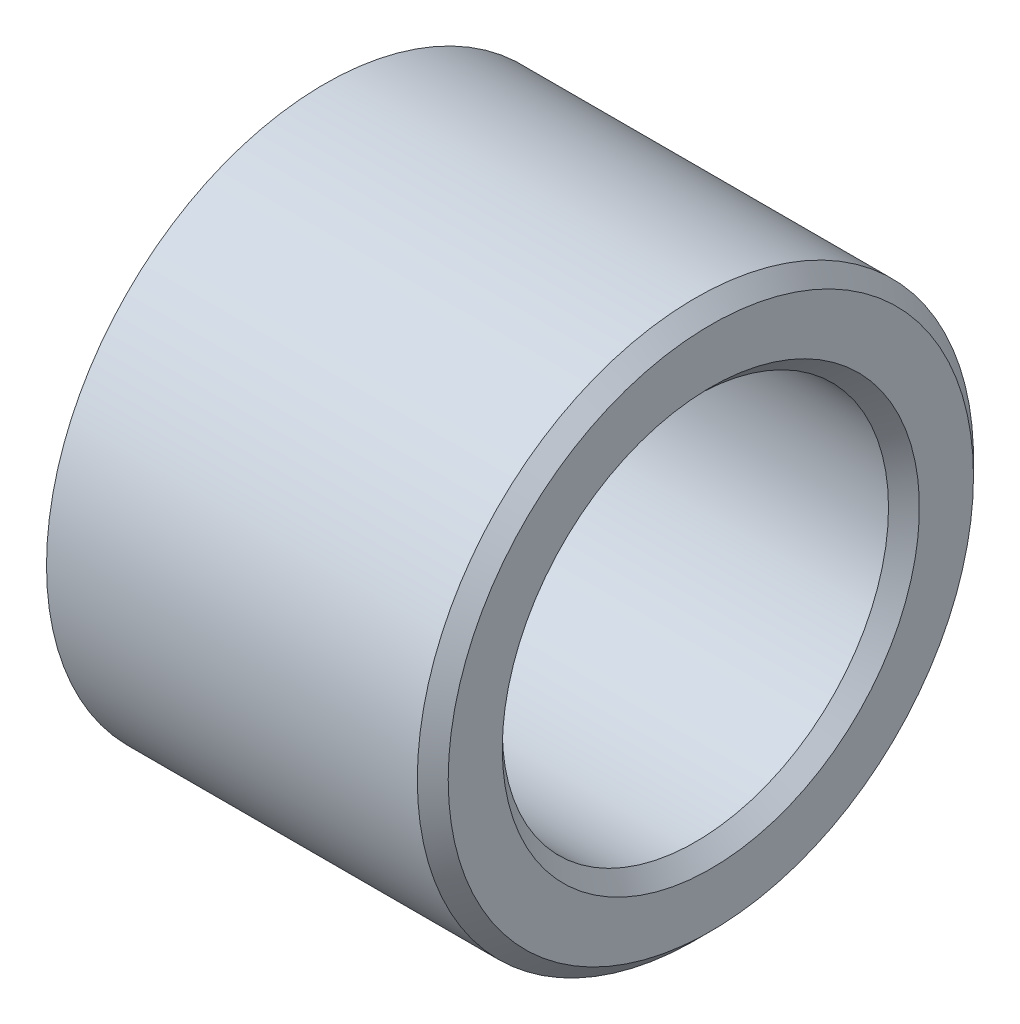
from build123d import *

# Parameters (mm, degrees)
ESQUISSE1_W     = 50
ESQUISSE1_H     = 11
CHANFREIN1_SIZE = 2


with BuildPart() as part:
    # Esquisse1 → Base-R_volution (revolve)
    with BuildSketch(Plane.XY, mode=Mode.PRIVATE) as base_r_volution_sk:
        with Locations((25, 30.5)):
            Rectangle(ESQUISSE1_W, ESQUISSE1_H)
    revolve(base_r_volution_sk.sketch.rotate(Axis((-5.543650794, 0, 0), (1, 0, 0)), 90), axis=Axis((-5.543650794, 0, 0), (1, 0, 0)))

    # Chanfrein1
    chanfrein1_edges = [part.edges().sort_by_distance(p)[0] for p in [
        (0, 0, -25),
        (50, 0, -36),
        (50, 0, -25),
    ]]
    chamfer(chanfrein1_edges, length=CHANFREIN1_SIZE)


solid = part.part
